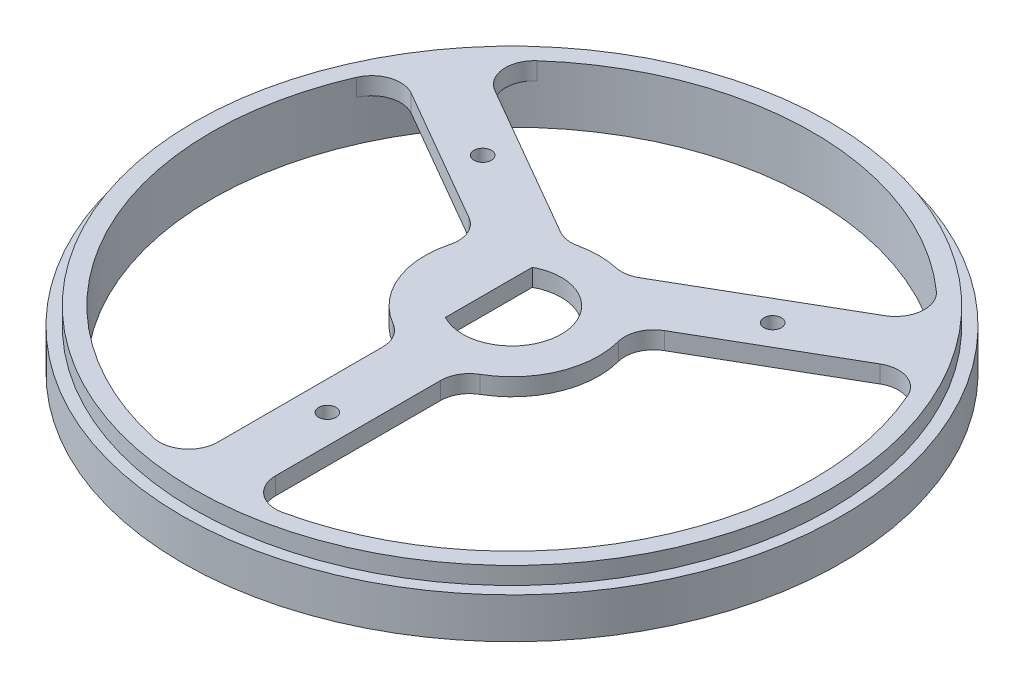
ISO-10303-21;
HEADER;
FILE_DESCRIPTION(('STEP AP214'),'2;1');
FILE_NAME('part.step','',(''),(''),'','','');
FILE_SCHEMA(('AUTOMOTIVE_DESIGN { 1 0 10303 214 1 1 1 1 }'));
ENDSEC;
DATA;
#1=APPLICATION_CONTEXT('core data for automotive mechanical design processes');
#2=APPLICATION_PROTOCOL_DEFINITION('international standard','automotive_design',2000,#1);
#3=PRODUCT_CONTEXT('',#1,'mechanical');
#4=PRODUCT('Part','Part','',(#3));
#5=PRODUCT_RELATED_PRODUCT_CATEGORY('part','',(#4));
#6=PRODUCT_DEFINITION_FORMATION('','',#4);
#7=PRODUCT_DEFINITION_CONTEXT('part definition',#1,'design');
#8=PRODUCT_DEFINITION('design','',#6,#7);
#9=PRODUCT_DEFINITION_SHAPE('','',#8);
#10=(LENGTH_UNIT() NAMED_UNIT(*) SI_UNIT(.MILLI.,.METRE.));
#11=(NAMED_UNIT(*) PLANE_ANGLE_UNIT() SI_UNIT($,.RADIAN.));
#12=(NAMED_UNIT(*) SI_UNIT($,.STERADIAN.) SOLID_ANGLE_UNIT());
#13=UNCERTAINTY_MEASURE_WITH_UNIT(LENGTH_MEASURE(1.E-05),#10,'distance_accuracy_value','');
#14=(GEOMETRIC_REPRESENTATION_CONTEXT(3) GLOBAL_UNCERTAINTY_ASSIGNED_CONTEXT((#13)) GLOBAL_UNIT_ASSIGNED_CONTEXT((#10,
#11,#12)) REPRESENTATION_CONTEXT('',''));
#15=CARTESIAN_POINT('',(0.,0.,0.));
#16=DIRECTION('',(0.,0.,1.));
#17=DIRECTION('',(1.,0.,0.));
#18=AXIS2_PLACEMENT_3D('',#15,#16,#17);
#19=CARTESIAN_POINT('',(0.,7.,0.));
#20=DIRECTION('',(0.,1.,0.));
#21=DIRECTION('',(0.,0.,1.));
#22=AXIS2_PLACEMENT_3D('',#19,#20,#21);
#23=PLANE('',#22);
#24=CARTESIAN_POINT('',(0.,7.,0.));
#25=DIRECTION('',(0.,1.,0.));
#26=DIRECTION('',(0.,0.,1.));
#27=AXIS2_PLACEMENT_3D('',#24,#25,#26);
#28=CIRCLE('',#27,54.85);
#29=CARTESIAN_POINT('',(0.,7.,54.85));
#30=VERTEX_POINT('',#29);
#31=EDGE_CURVE('E343',#30,#30,#28,.T.);
#32=ORIENTED_EDGE('',*,*,#31,.F.);
#33=EDGE_LOOP('',(#32));
#34=FACE_BOUND('',#33,.T.);
#35=CARTESIAN_POINT('',(0.,7.,0.));
#36=DIRECTION('',(0.,1.,0.));
#37=DIRECTION('',(0.,0.,1.));
#38=AXIS2_PLACEMENT_3D('',#35,#36,#37);
#39=CIRCLE('',#38,56.84006118);
#40=CARTESIAN_POINT('',(0.,7.,56.84006118));
#41=VERTEX_POINT('',#40);
#42=EDGE_CURVE('E348',#41,#41,#39,.T.);
#43=ORIENTED_EDGE('',*,*,#42,.T.);
#44=EDGE_LOOP('',(#43));
#45=FACE_BOUND('',#44,.T.);
#46=ADVANCED_FACE('F45',(#34,#45),#23,.T.);
#47=CARTESIAN_POINT('',(0.,0.,0.));
#48=DIRECTION('',(0.,1.,0.));
#49=DIRECTION('',(0.,0.,1.));
#50=AXIS2_PLACEMENT_3D('',#47,#48,#49);
#51=PLANE('',#50);
#52=CARTESIAN_POINT('',(0.,0.,0.));
#53=DIRECTION('',(0.,1.,0.));
#54=DIRECTION('',(0.,0.,1.));
#55=AXIS2_PLACEMENT_3D('',#52,#53,#54);
#56=CIRCLE('',#55,56.84006118);
#57=CARTESIAN_POINT('',(0.,0.,56.84006118));
#58=VERTEX_POINT('',#57);
#59=EDGE_CURVE('E352',#58,#58,#56,.T.);
#60=ORIENTED_EDGE('',*,*,#59,.F.);
#61=EDGE_LOOP('',(#60));
#62=FACE_BOUND('',#61,.T.);
#63=CARTESIAN_POINT('',(0.,0.,0.));
#64=DIRECTION('',(0.,1.,0.));
#65=DIRECTION('',(0.,0.,1.));
#66=AXIS2_PLACEMENT_3D('',#63,#64,#65);
#67=CIRCLE('',#66,51.85);
#68=CARTESIAN_POINT('',(0.,0.,51.85));
#69=VERTEX_POINT('',#68);
#70=EDGE_CURVE('E342',#69,#69,#67,.T.);
#71=ORIENTED_EDGE('',*,*,#70,.T.);
#72=EDGE_LOOP('',(#71));
#73=FACE_BOUND('',#72,.T.);
#74=ADVANCED_FACE('F560',(#62,#73),#51,.F.);
#75=CARTESIAN_POINT('',(0.,7.,0.));
#76=DIRECTION('',(0.,-1.,0.));
#77=DIRECTION('',(0.,0.,-1.));
#78=AXIS2_PLACEMENT_3D('',#75,#76,#77);
#79=CYLINDRICAL_SURFACE('',#78,56.84006118);
#80=ORIENTED_EDGE('',*,*,#42,.F.);
#81=EDGE_LOOP('',(#80));
#82=FACE_BOUND('',#81,.T.);
#83=ORIENTED_EDGE('',*,*,#59,.T.);
#84=EDGE_LOOP('',(#83));
#85=FACE_BOUND('',#84,.T.);
#86=ADVANCED_FACE('F568',(#82,#85),#79,.T.);
#87=CARTESIAN_POINT('',(0.,7.,0.));
#88=DIRECTION('',(0.,-1.,0.));
#89=DIRECTION('',(0.,0.,-1.));
#90=AXIS2_PLACEMENT_3D('',#87,#88,#89);
#91=CYLINDRICAL_SURFACE('',#90,51.85);
#92=CARTESIAN_POINT('',(0.,7.,0.));
#93=DIRECTION('',(0.,1.,0.));
#94=DIRECTION('',(0.,0.,1.));
#95=AXIS2_PLACEMENT_3D('',#92,#93,#94);
#96=CIRCLE('',#95,51.85);
#97=CARTESIAN_POINT('',(47.5268769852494,7.,-20.7272396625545));
#98=VERTEX_POINT('',#97);
#99=CARTESIAN_POINT('',(34.4600602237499,7.,-38.7417958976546));
#100=VERTEX_POINT('',#99);
#101=EDGE_CURVE('E276',#98,#100,#96,.T.);
#102=ORIENTED_EDGE('',*,*,#101,.T.);
#103=DIRECTION('',(0.,-1.,0.));
#104=VECTOR('',#103,1.);
#105=CARTESIAN_POINT('',(34.4600602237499,7.,-38.7417958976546));
#106=LINE('',#105,#104);
#107=CARTESIAN_POINT('',(34.4600602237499,10.,-38.7417958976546));
#108=VERTEX_POINT('',#107);
#109=EDGE_CURVE('E424',#100,#108,#106,.F.);
#110=ORIENTED_EDGE('',*,*,#109,.T.);
#111=CARTESIAN_POINT('',(0.,10.,0.));
#112=DIRECTION('',(0.,1.,0.));
#113=DIRECTION('',(0.,0.,1.));
#114=AXIS2_PLACEMENT_3D('',#111,#112,#113);
#115=CIRCLE('',#114,51.85);
#116=CARTESIAN_POINT('',(-34.4600602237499,10.,-38.7417958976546));
#117=VERTEX_POINT('',#116);
#118=EDGE_CURVE('E338',#108,#117,#115,.T.);
#119=ORIENTED_EDGE('',*,*,#118,.T.);
#120=DIRECTION('',(0.,-1.,0.));
#121=VECTOR('',#120,1.);
#122=CARTESIAN_POINT('',(-34.4600602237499,7.,-38.7417958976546));
#123=LINE('',#122,#121);
#124=CARTESIAN_POINT('',(-34.4600602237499,7.,-38.7417958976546));
#125=VERTEX_POINT('',#124);
#126=EDGE_CURVE('E420',#117,#125,#123,.T.);
#127=ORIENTED_EDGE('',*,*,#126,.T.);
#128=CARTESIAN_POINT('',(0.,7.,0.));
#129=DIRECTION('',(0.,1.,0.));
#130=DIRECTION('',(0.,0.,1.));
#131=AXIS2_PLACEMENT_3D('',#128,#129,#130);
#132=CIRCLE('',#131,51.85);
#133=CARTESIAN_POINT('',(-47.5268769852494,7.,-20.7272396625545));
#134=VERTEX_POINT('',#133);
#135=EDGE_CURVE('E291',#125,#134,#132,.T.);
#136=ORIENTED_EDGE('',*,*,#135,.T.);
#137=DIRECTION('',(0.,-1.,0.));
#138=VECTOR('',#137,1.);
#139=CARTESIAN_POINT('',(-47.5268769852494,7.,-20.7272396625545));
#140=LINE('',#139,#138);
#141=CARTESIAN_POINT('',(-47.5268769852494,10.,-20.7272396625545));
#142=VERTEX_POINT('',#141);
#143=EDGE_CURVE('E416',#134,#142,#140,.F.);
#144=ORIENTED_EDGE('',*,*,#143,.T.);
#145=CARTESIAN_POINT('',(-11.0672358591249,10.,50.6550963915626));
#146=VERTEX_POINT('',#145);
#147=EDGE_CURVE('E298',#142,#146,#115,.T.);
#148=ORIENTED_EDGE('',*,*,#147,.T.);
#149=DIRECTION('',(0.,-1.,0.));
#150=VECTOR('',#149,1.);
#151=CARTESIAN_POINT('',(-11.0672358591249,7.,50.6550963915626));
#152=LINE('',#151,#150);
#153=CARTESIAN_POINT('',(-11.0672358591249,7.,50.6550963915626));
#154=VERTEX_POINT('',#153);
#155=EDGE_CURVE('E412',#146,#154,#152,.T.);
#156=ORIENTED_EDGE('',*,*,#155,.T.);
#157=CARTESIAN_POINT('',(0.,7.,0.));
#158=DIRECTION('',(0.,1.,0.));
#159=DIRECTION('',(0.,0.,1.));
#160=AXIS2_PLACEMENT_3D('',#157,#158,#159);
#161=CIRCLE('',#160,51.85);
#162=CARTESIAN_POINT('',(11.0672358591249,7.,50.6550963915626));
#163=VERTEX_POINT('',#162);
#164=EDGE_CURVE('E261',#154,#163,#161,.T.);
#165=ORIENTED_EDGE('',*,*,#164,.T.);
#166=DIRECTION('',(0.,-1.,0.));
#167=VECTOR('',#166,1.);
#168=CARTESIAN_POINT('',(11.0672358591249,7.,50.6550963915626));
#169=LINE('',#168,#167);
#170=CARTESIAN_POINT('',(11.0672358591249,10.,50.6550963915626));
#171=VERTEX_POINT('',#170);
#172=EDGE_CURVE('E365',#163,#171,#169,.F.);
#173=ORIENTED_EDGE('',*,*,#172,.T.);
#174=CARTESIAN_POINT('',(47.5268769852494,10.,-20.7272396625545));
#175=VERTEX_POINT('',#174);
#176=EDGE_CURVE('E333',#171,#175,#115,.T.);
#177=ORIENTED_EDGE('',*,*,#176,.T.);
#178=DIRECTION('',(0.,-1.,0.));
#179=VECTOR('',#178,1.);
#180=CARTESIAN_POINT('',(47.5268769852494,7.,-20.7272396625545));
#181=LINE('',#180,#179);
#182=EDGE_CURVE('E369',#175,#98,#181,.T.);
#183=ORIENTED_EDGE('',*,*,#182,.T.);
#184=EDGE_LOOP('',(#102,#110,#119,#127,#136,#144,#148,#156,#165,#173,#177,#183));
#185=FACE_BOUND('',#184,.T.);
#186=ORIENTED_EDGE('',*,*,#70,.F.);
#187=EDGE_LOOP('',(#186));
#188=FACE_BOUND('',#187,.T.);
#189=ADVANCED_FACE('F522',(#185,#188),#91,.F.);
#190=CARTESIAN_POINT('',(0.,10.,0.));
#191=DIRECTION('',(0.,1.,0.));
#192=DIRECTION('',(0.,0.,1.));
#193=AXIS2_PLACEMENT_3D('',#190,#191,#192);
#194=PLANE('',#193);
#195=ORIENTED_EDGE('',*,*,#147,.F.);
#196=CARTESIAN_POINT('',(-42.9437644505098,10.,-18.728470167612));
#197=DIRECTION('',(0.,1.,0.));
#198=DIRECTION('',(0.,0.,1.));
#199=AXIS2_PLACEMENT_3D('',#196,#197,#198);
#200=CIRCLE('',#199,5.);
#201=CARTESIAN_POINT('',(-40.4437644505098,10.,-23.0585971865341));
#202=VERTEX_POINT('',#201);
#203=EDGE_CURVE('E494',#142,#202,#200,.F.);
#204=ORIENTED_EDGE('',*,*,#203,.T.);
#205=DIRECTION('',(0.866025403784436,0.,0.500000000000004));
#206=VECTOR('',#205,1.);
#207=CARTESIAN_POINT('',(-13.1148153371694,10.,-7.28022105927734));
#208=LINE('',#207,#206);
#209=CARTESIAN_POINT('',(-16.8387867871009,10.,-9.43025697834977));
#210=VERTEX_POINT('',#209);
#211=EDGE_CURVE('E258',#202,#210,#208,.T.);
#212=ORIENTED_EDGE('',*,*,#211,.T.);
#213=CARTESIAN_POINT('',(-19.3387867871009,10.,-5.10012995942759));
#214=DIRECTION('',(0.,1.,0.));
#215=DIRECTION('',(0.,0.,1.));
#216=AXIS2_PLACEMENT_3D('',#213,#214,#215);
#217=CIRCLE('',#216,5.);
#218=CARTESIAN_POINT('',(-14.5040900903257,10.,-3.82509746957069));
#219=VERTEX_POINT('',#218);
#220=EDGE_CURVE('E501',#210,#219,#217,.F.);
#221=ORIENTED_EDGE('',*,*,#220,.T.);
#222=CARTESIAN_POINT('',(0.,10.,0.));
#223=DIRECTION('',(0.,1.,0.));
#224=DIRECTION('',(0.,0.,1.));
#225=AXIS2_PLACEMENT_3D('',#222,#223,#224);
#226=CIRCLE('',#225,15.);
#227=CARTESIAN_POINT('',(-7.5,10.,12.9903810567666));
#228=VERTEX_POINT('',#227);
#229=EDGE_CURVE('E251',#219,#228,#226,.T.);
#230=ORIENTED_EDGE('',*,*,#229,.T.);
#231=CARTESIAN_POINT('',(-10.,10.,17.3205080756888));
#232=DIRECTION('',(0.,1.,0.));
#233=DIRECTION('',(0.,0.,1.));
#234=AXIS2_PLACEMENT_3D('',#231,#232,#233);
#235=CIRCLE('',#234,5.);
#236=CARTESIAN_POINT('',(-5.,10.,17.3205080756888));
#237=VERTEX_POINT('',#236);
#238=EDGE_CURVE('E507',#228,#237,#235,.F.);
#239=ORIENTED_EDGE('',*,*,#238,.T.);
#240=DIRECTION('',(0.,0.,1.));
#241=VECTOR('',#240,1.);
#242=CARTESIAN_POINT('',(-5.,10.,14.142135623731));
#243=LINE('',#242,#241);
#244=CARTESIAN_POINT('',(-5.,10.,45.7703233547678));
#245=VERTEX_POINT('',#244);
#246=EDGE_CURVE('E302',#237,#245,#243,.T.);
#247=ORIENTED_EDGE('',*,*,#246,.T.);
#248=CARTESIAN_POINT('',(-10.,10.,45.7703233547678));
#249=DIRECTION('',(0.,1.,0.));
#250=DIRECTION('',(0.,0.,1.));
#251=AXIS2_PLACEMENT_3D('',#248,#249,#250);
#252=CIRCLE('',#251,5.);
#253=EDGE_CURVE('E54',#245,#146,#252,.F.);
#254=ORIENTED_EDGE('',*,*,#253,.T.);
#255=EDGE_LOOP('',(#195,#204,#212,#221,#230,#239,#247,#254));
#256=FACE_BOUND('',#255,.T.);
#257=ORIENTED_EDGE('',*,*,#118,.F.);
#258=CARTESIAN_POINT('',(31.1370071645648,10.,-35.0058464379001));
#259=DIRECTION('',(0.,1.,0.));
#260=DIRECTION('',(0.,0.,1.));
#261=AXIS2_PLACEMENT_3D('',#258,#259,#260);
#262=CIRCLE('',#261,5.);
#263=CARTESIAN_POINT('',(33.6370071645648,10.,-30.6757194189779));
#264=VERTEX_POINT('',#263);
#265=EDGE_CURVE('E469',#108,#264,#262,.F.);
#266=ORIENTED_EDGE('',*,*,#265,.T.);
#267=DIRECTION('',(-0.866025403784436,0.,0.500000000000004));
#268=VECTOR('',#267,1.);
#269=CARTESIAN_POINT('',(5.,10.,-14.142135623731));
#270=LINE('',#269,#268);
#271=CARTESIAN_POINT('',(6.82604347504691,10.,-15.1964023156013));
#272=VERTEX_POINT('',#271);
#273=EDGE_CURVE('E318',#264,#272,#270,.T.);
#274=ORIENTED_EDGE('',*,*,#273,.T.);
#275=CARTESIAN_POINT('',(4.32604347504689,10.,-19.5265293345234));
#276=DIRECTION('',(0.,1.,0.));
#277=DIRECTION('',(0.,0.,1.));
#278=AXIS2_PLACEMENT_3D('',#275,#276,#277);
#279=CIRCLE('',#278,5.);
#280=CARTESIAN_POINT('',(3.24453260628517,10.,-14.6448970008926));
#281=VERTEX_POINT('',#280);
#282=EDGE_CURVE('E476',#272,#281,#279,.F.);
#283=ORIENTED_EDGE('',*,*,#282,.T.);
#284=CARTESIAN_POINT('',(0.,10.,0.));
#285=DIRECTION('',(0.,1.,0.));
#286=DIRECTION('',(0.,0.,1.));
#287=AXIS2_PLACEMENT_3D('',#284,#285,#286);
#288=CIRCLE('',#287,15.);
#289=CARTESIAN_POINT('',(-3.24453260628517,10.,-14.6448970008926));
#290=VERTEX_POINT('',#289);
#291=EDGE_CURVE('E322',#281,#290,#288,.T.);
#292=ORIENTED_EDGE('',*,*,#291,.T.);
#293=CARTESIAN_POINT('',(-4.32604347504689,10.,-19.5265293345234));
#294=DIRECTION('',(0.,1.,0.));
#295=DIRECTION('',(0.,0.,1.));
#296=AXIS2_PLACEMENT_3D('',#293,#294,#295);
#297=CIRCLE('',#296,5.);
#298=CARTESIAN_POINT('',(-6.82604347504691,10.,-15.1964023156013));
#299=VERTEX_POINT('',#298);
#300=EDGE_CURVE('E482',#290,#299,#297,.F.);
#301=ORIENTED_EDGE('',*,*,#300,.T.);
#302=DIRECTION('',(-0.866025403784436,0.,-0.500000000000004));
#303=VECTOR('',#302,1.);
#304=CARTESIAN_POINT('',(-5.,10.,-14.142135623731));
#305=LINE('',#304,#303);
#306=CARTESIAN_POINT('',(-33.6370071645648,10.,-30.6757194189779));
#307=VERTEX_POINT('',#306);
#308=EDGE_CURVE('E326',#299,#307,#305,.T.);
#309=ORIENTED_EDGE('',*,*,#308,.T.);
#310=CARTESIAN_POINT('',(-31.1370071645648,10.,-35.0058464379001));
#311=DIRECTION('',(0.,1.,0.));
#312=DIRECTION('',(0.,0.,1.));
#313=AXIS2_PLACEMENT_3D('',#310,#311,#312);
#314=CIRCLE('',#313,5.);
#315=EDGE_CURVE('E488',#307,#117,#314,.F.);
#316=ORIENTED_EDGE('',*,*,#315,.T.);
#317=EDGE_LOOP('',(#257,#266,#274,#283,#292,#301,#309,#316));
#318=FACE_BOUND('',#317,.T.);
#319=CARTESIAN_POINT('',(0.,10.,0.));
#320=DIRECTION('',(0.,1.,0.));
#321=DIRECTION('',(0.,0.,1.));
#322=AXIS2_PLACEMENT_3D('',#319,#320,#321);
#323=CIRCLE('',#322,54.85);
#324=CARTESIAN_POINT('',(0.,10.,54.85));
#325=VERTEX_POINT('',#324);
#326=EDGE_CURVE('E337',#325,#325,#323,.T.);
#327=ORIENTED_EDGE('',*,*,#326,.T.);
#328=EDGE_LOOP('',(#327));
#329=FACE_BOUND('',#328,.T.);
#330=ORIENTED_EDGE('',*,*,#176,.F.);
#331=CARTESIAN_POINT('',(10.,10.,45.7703233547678));
#332=DIRECTION('',(0.,1.,0.));
#333=DIRECTION('',(0.,0.,1.));
#334=AXIS2_PLACEMENT_3D('',#331,#332,#333);
#335=CIRCLE('',#334,5.);
#336=CARTESIAN_POINT('',(5.,10.,45.7703233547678));
#337=VERTEX_POINT('',#336);
#338=EDGE_CURVE('E393',#171,#337,#335,.F.);
#339=ORIENTED_EDGE('',*,*,#338,.T.);
#340=DIRECTION('',(0.,0.,-1.));
#341=VECTOR('',#340,1.);
#342=CARTESIAN_POINT('',(5.,10.,14.142135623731));
#343=LINE('',#342,#341);
#344=CARTESIAN_POINT('',(5.,10.,17.3205080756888));
#345=VERTEX_POINT('',#344);
#346=EDGE_CURVE('E306',#337,#345,#343,.T.);
#347=ORIENTED_EDGE('',*,*,#346,.T.);
#348=CARTESIAN_POINT('',(10.,10.,17.3205080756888));
#349=DIRECTION('',(0.,1.,0.));
#350=DIRECTION('',(0.,0.,1.));
#351=AXIS2_PLACEMENT_3D('',#348,#349,#350);
#352=CIRCLE('',#351,5.);
#353=CARTESIAN_POINT('',(7.5,10.,12.9903810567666));
#354=VERTEX_POINT('',#353);
#355=EDGE_CURVE('E406',#345,#354,#352,.F.);
#356=ORIENTED_EDGE('',*,*,#355,.T.);
#357=CARTESIAN_POINT('',(0.,10.,0.));
#358=DIRECTION('',(0.,1.,0.));
#359=DIRECTION('',(0.,0.,1.));
#360=AXIS2_PLACEMENT_3D('',#357,#358,#359);
#361=CIRCLE('',#360,15.);
#362=CARTESIAN_POINT('',(14.5040900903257,10.,-3.82509746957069));
#363=VERTEX_POINT('',#362);
#364=EDGE_CURVE('E310',#354,#363,#361,.T.);
#365=ORIENTED_EDGE('',*,*,#364,.T.);
#366=CARTESIAN_POINT('',(19.3387867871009,10.,-5.10012995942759));
#367=DIRECTION('',(0.,1.,0.));
#368=DIRECTION('',(0.,0.,1.));
#369=AXIS2_PLACEMENT_3D('',#366,#367,#368);
#370=CIRCLE('',#369,5.);
#371=CARTESIAN_POINT('',(16.8387867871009,10.,-9.43025697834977));
#372=VERTEX_POINT('',#371);
#373=EDGE_CURVE('E400',#363,#372,#370,.F.);
#374=ORIENTED_EDGE('',*,*,#373,.T.);
#375=DIRECTION('',(0.866025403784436,0.,-0.500000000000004));
#376=VECTOR('',#375,1.);
#377=CARTESIAN_POINT('',(13.1148153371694,10.,-7.28022105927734));
#378=LINE('',#377,#376);
#379=CARTESIAN_POINT('',(40.4437644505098,10.,-23.0585971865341));
#380=VERTEX_POINT('',#379);
#381=EDGE_CURVE('E314',#372,#380,#378,.T.);
#382=ORIENTED_EDGE('',*,*,#381,.T.);
#383=CARTESIAN_POINT('',(42.9437644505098,10.,-18.728470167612));
#384=DIRECTION('',(0.,1.,0.));
#385=DIRECTION('',(0.,0.,1.));
#386=AXIS2_PLACEMENT_3D('',#383,#384,#385);
#387=CIRCLE('',#386,5.);
#388=EDGE_CURVE('E387',#380,#175,#387,.F.);
#389=ORIENTED_EDGE('',*,*,#388,.T.);
#390=EDGE_LOOP('',(#330,#339,#347,#356,#365,#374,#382,#389));
#391=FACE_BOUND('',#390,.T.);
#392=CARTESIAN_POINT('',(0.,10.,31.85));
#393=DIRECTION('',(0.,1.,0.));
#394=DIRECTION('',(0.,0.,1.));
#395=AXIS2_PLACEMENT_3D('',#392,#393,#394);
#396=CIRCLE('',#395,1.5);
#397=CARTESIAN_POINT('',(0.,10.,33.35));
#398=VERTEX_POINT('',#397);
#399=EDGE_CURVE('E928',#398,#398,#396,.T.);
#400=ORIENTED_EDGE('',*,*,#399,.F.);
#401=EDGE_LOOP('',(#400));
#402=FACE_BOUND('',#401,.T.);
#403=CARTESIAN_POINT('',(25.0075662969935,10.,-19.9458948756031));
#404=DIRECTION('',(0.,1.,0.));
#405=DIRECTION('',(0.,0.,1.));
#406=AXIS2_PLACEMENT_3D('',#403,#404,#405);
#407=CIRCLE('',#406,1.5);
#408=CARTESIAN_POINT('',(25.0075662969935,10.,-18.4458948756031));
#409=VERTEX_POINT('',#408);
#410=EDGE_CURVE('E922',#409,#409,#407,.T.);
#411=ORIENTED_EDGE('',*,*,#410,.F.);
#412=EDGE_LOOP('',(#411));
#413=FACE_BOUND('',#412,.T.);
#414=CARTESIAN_POINT('',(-25.0075662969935,10.,-19.9458948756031));
#415=DIRECTION('',(0.,1.,0.));
#416=DIRECTION('',(0.,0.,1.));
#417=AXIS2_PLACEMENT_3D('',#414,#415,#416);
#418=CIRCLE('',#417,1.5);
#419=CARTESIAN_POINT('',(-25.0075662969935,10.,-18.4458948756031));
#420=VERTEX_POINT('',#419);
#421=EDGE_CURVE('E244',#420,#420,#418,.T.);
#422=ORIENTED_EDGE('',*,*,#421,.F.);
#423=EDGE_LOOP('',(#422));
#424=FACE_BOUND('',#423,.T.);
#425=DIRECTION('',(0.,0.,1.));
#426=VECTOR('',#425,1.);
#427=CARTESIAN_POINT('',(-4.,10.,0.));
#428=LINE('',#427,#426);
#429=CARTESIAN_POINT('',(-4.,10.,-7.5));
#430=VERTEX_POINT('',#429);
#431=CARTESIAN_POINT('',(-4.,10.,7.5));
#432=VERTEX_POINT('',#431);
#433=EDGE_CURVE('E225',#430,#432,#428,.T.);
#434=ORIENTED_EDGE('',*,*,#433,.F.);
#435=CARTESIAN_POINT('',(0.,10.,0.));
#436=DIRECTION('',(0.,1.,0.));
#437=DIRECTION('',(0.,0.,1.));
#438=AXIS2_PLACEMENT_3D('',#435,#436,#437);
#439=CIRCLE('',#438,8.5);
#440=EDGE_CURVE('E241',#432,#430,#439,.T.);
#441=ORIENTED_EDGE('',*,*,#440,.F.);
#442=EDGE_LOOP('',(#434,#441));
#443=FACE_BOUND('',#442,.T.);
#444=ADVANCED_FACE('F516',(#256,#318,#329,#391,#402,#413,#424,#443),#194,.T.);
#445=CARTESIAN_POINT('',(0.,10.,0.));
#446=DIRECTION('',(0.,-1.,0.));
#447=DIRECTION('',(0.,0.,-1.));
#448=AXIS2_PLACEMENT_3D('',#445,#446,#447);
#449=CYLINDRICAL_SURFACE('',#448,54.85);
#450=ORIENTED_EDGE('',*,*,#326,.F.);
#451=EDGE_LOOP('',(#450));
#452=FACE_BOUND('',#451,.T.);
#453=ORIENTED_EDGE('',*,*,#31,.T.);
#454=EDGE_LOOP('',(#453));
#455=FACE_BOUND('',#454,.T.);
#456=ADVANCED_FACE('F664',(#452,#455),#449,.T.);
#457=CARTESIAN_POINT('',(0.,7.,0.));
#458=DIRECTION('',(0.,1.,0.));
#459=DIRECTION('',(0.,0.,1.));
#460=AXIS2_PLACEMENT_3D('',#457,#458,#459);
#461=CYLINDRICAL_SURFACE('',#460,15.);
#462=ORIENTED_EDGE('',*,*,#229,.F.);
#463=DIRECTION('',(0.,1.,0.));
#464=VECTOR('',#463,1.);
#465=CARTESIAN_POINT('',(-14.5040900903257,7.,-3.82509746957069));
#466=LINE('',#465,#464);
#467=CARTESIAN_POINT('',(-14.5040900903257,7.,-3.82509746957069));
#468=VERTEX_POINT('',#467);
#469=EDGE_CURVE('E460',#219,#468,#466,.F.);
#470=ORIENTED_EDGE('',*,*,#469,.T.);
#471=CARTESIAN_POINT('',(0.,7.,0.));
#472=DIRECTION('',(0.,1.,0.));
#473=DIRECTION('',(0.,0.,1.));
#474=AXIS2_PLACEMENT_3D('',#471,#472,#473);
#475=CIRCLE('',#474,15.);
#476=CARTESIAN_POINT('',(-7.5,7.,12.9903810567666));
#477=VERTEX_POINT('',#476);
#478=EDGE_CURVE('E253',#468,#477,#475,.T.);
#479=ORIENTED_EDGE('',*,*,#478,.T.);
#480=DIRECTION('',(0.,1.,0.));
#481=VECTOR('',#480,1.);
#482=CARTESIAN_POINT('',(-7.5,7.,12.9903810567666));
#483=LINE('',#482,#481);
#484=EDGE_CURVE('E456',#477,#228,#483,.T.);
#485=ORIENTED_EDGE('',*,*,#484,.T.);
#486=EDGE_LOOP('',(#462,#470,#479,#485));
#487=FACE_BOUND('',#486,.T.);
#488=ADVANCED_FACE('F534',(#487),#461,.T.);
#489=CARTESIAN_POINT('',(-13.1148153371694,7.,-7.28022105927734));
#490=DIRECTION('',(-0.500000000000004,0.,0.866025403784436));
#491=DIRECTION('',(0.866025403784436,0.,0.500000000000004));
#492=AXIS2_PLACEMENT_3D('',#489,#490,#491);
#493=PLANE('',#492);
#494=ORIENTED_EDGE('',*,*,#211,.F.);
#495=DIRECTION('',(0.,1.,0.));
#496=VECTOR('',#495,1.);
#497=CARTESIAN_POINT('',(-40.4437644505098,7.,-23.0585971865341));
#498=LINE('',#497,#496);
#499=CARTESIAN_POINT('',(-40.4437644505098,7.,-23.0585971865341));
#500=VERTEX_POINT('',#499);
#501=EDGE_CURVE('E453',#202,#500,#498,.F.);
#502=ORIENTED_EDGE('',*,*,#501,.T.);
#503=DIRECTION('',(0.866025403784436,0.,0.500000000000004));
#504=VECTOR('',#503,1.);
#505=CARTESIAN_POINT('',(-13.1148153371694,7.,-7.28022105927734));
#506=LINE('',#505,#504);
#507=CARTESIAN_POINT('',(-16.8387867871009,7.,-9.43025697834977));
#508=VERTEX_POINT('',#507);
#509=EDGE_CURVE('E294',#500,#508,#506,.T.);
#510=ORIENTED_EDGE('',*,*,#509,.T.);
#511=DIRECTION('',(0.,-1.,0.));
#512=VECTOR('',#511,1.);
#513=CARTESIAN_POINT('',(-16.8387867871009,10.,-9.43025697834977));
#514=LINE('',#513,#512);
#515=EDGE_CURVE('E449',#508,#210,#514,.F.);
#516=ORIENTED_EDGE('',*,*,#515,.T.);
#517=EDGE_LOOP('',(#494,#502,#510,#516));
#518=FACE_BOUND('',#517,.T.);
#519=ADVANCED_FACE('F542',(#518),#493,.T.);
#520=CARTESIAN_POINT('',(-5.,7.,-14.142135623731));
#521=DIRECTION('',(0.500000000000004,0.,-0.866025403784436));
#522=DIRECTION('',(-0.866025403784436,0.,-0.500000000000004));
#523=AXIS2_PLACEMENT_3D('',#520,#521,#522);
#524=PLANE('',#523);
#525=ORIENTED_EDGE('',*,*,#308,.F.);
#526=DIRECTION('',(0.,-1.,0.));
#527=VECTOR('',#526,1.);
#528=CARTESIAN_POINT('',(-6.82604347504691,7.,-15.1964023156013));
#529=LINE('',#528,#527);
#530=CARTESIAN_POINT('',(-6.82604347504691,7.,-15.1964023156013));
#531=VERTEX_POINT('',#530);
#532=EDGE_CURVE('E446',#299,#531,#529,.T.);
#533=ORIENTED_EDGE('',*,*,#532,.T.);
#534=DIRECTION('',(-0.866025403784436,0.,-0.500000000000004));
#535=VECTOR('',#534,1.);
#536=CARTESIAN_POINT('',(-5.,7.,-14.142135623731));
#537=LINE('',#536,#535);
#538=CARTESIAN_POINT('',(-33.6370071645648,7.,-30.6757194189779));
#539=VERTEX_POINT('',#538);
#540=EDGE_CURVE('E287',#531,#539,#537,.T.);
#541=ORIENTED_EDGE('',*,*,#540,.T.);
#542=DIRECTION('',(0.,1.,0.));
#543=VECTOR('',#542,1.);
#544=CARTESIAN_POINT('',(-33.6370071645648,10.,-30.6757194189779));
#545=LINE('',#544,#543);
#546=EDGE_CURVE('E442',#539,#307,#545,.T.);
#547=ORIENTED_EDGE('',*,*,#546,.T.);
#548=EDGE_LOOP('',(#525,#533,#541,#547));
#549=FACE_BOUND('',#548,.T.);
#550=ADVANCED_FACE('F844',(#549),#524,.T.);
#551=CARTESIAN_POINT('',(0.,7.,0.));
#552=DIRECTION('',(0.,1.,0.));
#553=DIRECTION('',(0.,0.,1.));
#554=AXIS2_PLACEMENT_3D('',#551,#552,#553);
#555=CYLINDRICAL_SURFACE('',#554,15.);
#556=ORIENTED_EDGE('',*,*,#291,.F.);
#557=DIRECTION('',(0.,1.,0.));
#558=VECTOR('',#557,1.);
#559=CARTESIAN_POINT('',(3.24453260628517,7.,-14.6448970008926));
#560=LINE('',#559,#558);
#561=CARTESIAN_POINT('',(3.24453260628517,7.,-14.6448970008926));
#562=VERTEX_POINT('',#561);
#563=EDGE_CURVE('E439',#281,#562,#560,.F.);
#564=ORIENTED_EDGE('',*,*,#563,.T.);
#565=CARTESIAN_POINT('',(0.,7.,0.));
#566=DIRECTION('',(0.,1.,0.));
#567=DIRECTION('',(0.,0.,1.));
#568=AXIS2_PLACEMENT_3D('',#565,#566,#567);
#569=CIRCLE('',#568,15.);
#570=CARTESIAN_POINT('',(-3.24453260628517,7.,-14.6448970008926));
#571=VERTEX_POINT('',#570);
#572=EDGE_CURVE('E283',#562,#571,#569,.T.);
#573=ORIENTED_EDGE('',*,*,#572,.T.);
#574=DIRECTION('',(0.,1.,0.));
#575=VECTOR('',#574,1.);
#576=CARTESIAN_POINT('',(-3.24453260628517,7.,-14.6448970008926));
#577=LINE('',#576,#575);
#578=EDGE_CURVE('E435',#571,#290,#577,.T.);
#579=ORIENTED_EDGE('',*,*,#578,.T.);
#580=EDGE_LOOP('',(#556,#564,#573,#579));
#581=FACE_BOUND('',#580,.T.);
#582=ADVANCED_FACE('F615',(#581),#555,.T.);
#583=CARTESIAN_POINT('',(5.,7.,-14.142135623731));
#584=DIRECTION('',(-0.500000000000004,0.,-0.866025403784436));
#585=DIRECTION('',(-0.866025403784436,0.,0.500000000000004));
#586=AXIS2_PLACEMENT_3D('',#583,#584,#585);
#587=PLANE('',#586);
#588=ORIENTED_EDGE('',*,*,#273,.F.);
#589=DIRECTION('',(0.,1.,0.));
#590=VECTOR('',#589,1.);
#591=CARTESIAN_POINT('',(33.6370071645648,7.,-30.6757194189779));
#592=LINE('',#591,#590);
#593=CARTESIAN_POINT('',(33.6370071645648,7.,-30.6757194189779));
#594=VERTEX_POINT('',#593);
#595=EDGE_CURVE('E432',#264,#594,#592,.F.);
#596=ORIENTED_EDGE('',*,*,#595,.T.);
#597=DIRECTION('',(-0.866025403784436,0.,0.500000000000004));
#598=VECTOR('',#597,1.);
#599=CARTESIAN_POINT('',(5.,7.,-14.142135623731));
#600=LINE('',#599,#598);
#601=CARTESIAN_POINT('',(6.82604347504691,7.,-15.1964023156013));
#602=VERTEX_POINT('',#601);
#603=EDGE_CURVE('E279',#594,#602,#600,.T.);
#604=ORIENTED_EDGE('',*,*,#603,.T.);
#605=DIRECTION('',(0.,-1.,0.));
#606=VECTOR('',#605,1.);
#607=CARTESIAN_POINT('',(6.82604347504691,10.,-15.1964023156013));
#608=LINE('',#607,#606);
#609=EDGE_CURVE('E428',#602,#272,#608,.F.);
#610=ORIENTED_EDGE('',*,*,#609,.T.);
#611=EDGE_LOOP('',(#588,#596,#604,#610));
#612=FACE_BOUND('',#611,.T.);
#613=ADVANCED_FACE('F622',(#612),#587,.T.);
#614=CARTESIAN_POINT('',(13.1148153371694,7.,-7.28022105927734));
#615=DIRECTION('',(0.500000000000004,0.,0.866025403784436));
#616=DIRECTION('',(0.866025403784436,0.,-0.500000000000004));
#617=AXIS2_PLACEMENT_3D('',#614,#615,#616);
#618=PLANE('',#617);
#619=DIRECTION('',(0.866025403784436,0.,-0.500000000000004));
#620=VECTOR('',#619,1.);
#621=CARTESIAN_POINT('',(13.1148153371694,7.,-7.28022105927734));
#622=LINE('',#621,#620);
#623=CARTESIAN_POINT('',(16.8387867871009,7.,-9.43025697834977));
#624=VERTEX_POINT('',#623);
#625=CARTESIAN_POINT('',(40.4437644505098,7.,-23.0585971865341));
#626=VERTEX_POINT('',#625);
#627=EDGE_CURVE('E272',#624,#626,#622,.T.);
#628=ORIENTED_EDGE('',*,*,#627,.T.);
#629=DIRECTION('',(0.,1.,0.));
#630=VECTOR('',#629,1.);
#631=CARTESIAN_POINT('',(40.4437644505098,10.,-23.0585971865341));
#632=LINE('',#631,#630);
#633=EDGE_CURVE('E361',#626,#380,#632,.T.);
#634=ORIENTED_EDGE('',*,*,#633,.T.);
#635=ORIENTED_EDGE('',*,*,#381,.F.);
#636=DIRECTION('',(0.,-1.,0.));
#637=VECTOR('',#636,1.);
#638=CARTESIAN_POINT('',(16.8387867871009,7.,-9.43025697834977));
#639=LINE('',#638,#637);
#640=EDGE_CURVE('E347',#372,#624,#639,.T.);
#641=ORIENTED_EDGE('',*,*,#640,.T.);
#642=EDGE_LOOP('',(#628,#634,#635,#641));
#643=FACE_BOUND('',#642,.T.);
#644=ADVANCED_FACE('F632',(#643),#618,.T.);
#645=CARTESIAN_POINT('',(0.,7.,0.));
#646=DIRECTION('',(0.,1.,0.));
#647=DIRECTION('',(0.,0.,1.));
#648=AXIS2_PLACEMENT_3D('',#645,#646,#647);
#649=CYLINDRICAL_SURFACE('',#648,15.);
#650=CARTESIAN_POINT('',(0.,7.,0.));
#651=DIRECTION('',(0.,1.,0.));
#652=DIRECTION('',(0.,0.,1.));
#653=AXIS2_PLACEMENT_3D('',#650,#651,#652);
#654=CIRCLE('',#653,15.);
#655=CARTESIAN_POINT('',(7.5,7.,12.9903810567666));
#656=VERTEX_POINT('',#655);
#657=CARTESIAN_POINT('',(14.5040900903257,7.,-3.82509746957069));
#658=VERTEX_POINT('',#657);
#659=EDGE_CURVE('E268',#656,#658,#654,.T.);
#660=ORIENTED_EDGE('',*,*,#659,.T.);
#661=DIRECTION('',(0.,1.,0.));
#662=VECTOR('',#661,1.);
#663=CARTESIAN_POINT('',(14.5040900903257,7.,-3.82509746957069));
#664=LINE('',#663,#662);
#665=EDGE_CURVE('E383',#658,#363,#664,.T.);
#666=ORIENTED_EDGE('',*,*,#665,.T.);
#667=ORIENTED_EDGE('',*,*,#364,.F.);
#668=DIRECTION('',(0.,1.,0.));
#669=VECTOR('',#668,1.);
#670=CARTESIAN_POINT('',(7.5,7.,12.9903810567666));
#671=LINE('',#670,#669);
#672=EDGE_CURVE('E380',#354,#656,#671,.F.);
#673=ORIENTED_EDGE('',*,*,#672,.T.);
#674=EDGE_LOOP('',(#660,#666,#667,#673));
#675=FACE_BOUND('',#674,.T.);
#676=ADVANCED_FACE('F640',(#675),#649,.T.);
#677=CARTESIAN_POINT('',(5.,7.,14.142135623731));
#678=DIRECTION('',(1.,0.,0.));
#679=DIRECTION('',(0.,0.,-1.));
#680=AXIS2_PLACEMENT_3D('',#677,#678,#679);
#681=PLANE('',#680);
#682=ORIENTED_EDGE('',*,*,#346,.F.);
#683=DIRECTION('',(0.,1.,0.));
#684=VECTOR('',#683,1.);
#685=CARTESIAN_POINT('',(5.,7.,45.7703233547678));
#686=LINE('',#685,#684);
#687=CARTESIAN_POINT('',(5.,7.,45.7703233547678));
#688=VERTEX_POINT('',#687);
#689=EDGE_CURVE('E377',#337,#688,#686,.F.);
#690=ORIENTED_EDGE('',*,*,#689,.T.);
#691=DIRECTION('',(0.,0.,-1.));
#692=VECTOR('',#691,1.);
#693=CARTESIAN_POINT('',(5.,7.,14.142135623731));
#694=LINE('',#693,#692);
#695=CARTESIAN_POINT('',(5.,7.,17.3205080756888));
#696=VERTEX_POINT('',#695);
#697=EDGE_CURVE('E264',#688,#696,#694,.T.);
#698=ORIENTED_EDGE('',*,*,#697,.T.);
#699=DIRECTION('',(0.,-1.,0.));
#700=VECTOR('',#699,1.);
#701=CARTESIAN_POINT('',(5.,10.,17.3205080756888));
#702=LINE('',#701,#700);
#703=EDGE_CURVE('E373',#696,#345,#702,.F.);
#704=ORIENTED_EDGE('',*,*,#703,.T.);
#705=EDGE_LOOP('',(#682,#690,#698,#704));
#706=FACE_BOUND('',#705,.T.);
#707=ADVANCED_FACE('F648',(#706),#681,.T.);
#708=CARTESIAN_POINT('',(-5.,7.,14.142135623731));
#709=DIRECTION('',(-1.,0.,0.));
#710=DIRECTION('',(0.,0.,1.));
#711=AXIS2_PLACEMENT_3D('',#708,#709,#710);
#712=PLANE('',#711);
#713=ORIENTED_EDGE('',*,*,#246,.F.);
#714=DIRECTION('',(0.,-1.,0.));
#715=VECTOR('',#714,1.);
#716=CARTESIAN_POINT('',(-5.,7.,17.3205080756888));
#717=LINE('',#716,#715);
#718=CARTESIAN_POINT('',(-5.,7.,17.3205080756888));
#719=VERTEX_POINT('',#718);
#720=EDGE_CURVE('E66',#237,#719,#717,.T.);
#721=ORIENTED_EDGE('',*,*,#720,.T.);
#722=DIRECTION('',(0.,0.,1.));
#723=VECTOR('',#722,1.);
#724=CARTESIAN_POINT('',(-5.,7.,14.142135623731));
#725=LINE('',#724,#723);
#726=CARTESIAN_POINT('',(-5.,7.,45.7703233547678));
#727=VERTEX_POINT('',#726);
#728=EDGE_CURVE('E257',#719,#727,#725,.T.);
#729=ORIENTED_EDGE('',*,*,#728,.T.);
#730=DIRECTION('',(0.,1.,0.));
#731=VECTOR('',#730,1.);
#732=CARTESIAN_POINT('',(-5.,10.,45.7703233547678));
#733=LINE('',#732,#731);
#734=EDGE_CURVE('E463',#727,#245,#733,.T.);
#735=ORIENTED_EDGE('',*,*,#734,.T.);
#736=EDGE_LOOP('',(#713,#721,#729,#735));
#737=FACE_BOUND('',#736,.T.);
#738=ADVANCED_FACE('F526',(#737),#712,.T.);
#739=CARTESIAN_POINT('',(0.,7.,0.));
#740=DIRECTION('',(0.,1.,0.));
#741=DIRECTION('',(0.,0.,1.));
#742=AXIS2_PLACEMENT_3D('',#739,#740,#741);
#743=PLANE('',#742);
#744=CARTESIAN_POINT('',(0.,7.,31.85));
#745=DIRECTION('',(0.,1.,0.));
#746=DIRECTION('',(0.,0.,1.));
#747=AXIS2_PLACEMENT_3D('',#744,#745,#746);
#748=CIRCLE('',#747,1.5);
#749=CARTESIAN_POINT('',(0.,7.,33.35));
#750=VERTEX_POINT('',#749);
#751=EDGE_CURVE('E911',#750,#750,#748,.T.);
#752=ORIENTED_EDGE('',*,*,#751,.T.);
#753=EDGE_LOOP('',(#752));
#754=FACE_BOUND('',#753,.T.);
#755=CARTESIAN_POINT('',(25.0075662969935,7.,-19.9458948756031));
#756=DIRECTION('',(0.,1.,0.));
#757=DIRECTION('',(0.,0.,1.));
#758=AXIS2_PLACEMENT_3D('',#755,#756,#757);
#759=CIRCLE('',#758,1.5);
#760=CARTESIAN_POINT('',(25.0075662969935,7.,-18.4458948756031));
#761=VERTEX_POINT('',#760);
#762=EDGE_CURVE('E915',#761,#761,#759,.T.);
#763=ORIENTED_EDGE('',*,*,#762,.T.);
#764=EDGE_LOOP('',(#763));
#765=FACE_BOUND('',#764,.T.);
#766=CARTESIAN_POINT('',(-25.0075662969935,7.,-19.9458948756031));
#767=DIRECTION('',(0.,1.,0.));
#768=DIRECTION('',(0.,0.,1.));
#769=AXIS2_PLACEMENT_3D('',#766,#767,#768);
#770=CIRCLE('',#769,1.5);
#771=CARTESIAN_POINT('',(-25.0075662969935,7.,-18.4458948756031));
#772=VERTEX_POINT('',#771);
#773=EDGE_CURVE('E248',#772,#772,#770,.T.);
#774=ORIENTED_EDGE('',*,*,#773,.T.);
#775=EDGE_LOOP('',(#774));
#776=FACE_BOUND('',#775,.T.);
#777=CARTESIAN_POINT('',(0.,7.,0.));
#778=DIRECTION('',(0.,1.,0.));
#779=DIRECTION('',(0.,0.,1.));
#780=AXIS2_PLACEMENT_3D('',#777,#778,#779);
#781=CIRCLE('',#780,8.5);
#782=CARTESIAN_POINT('',(-4.,7.,7.5));
#783=VERTEX_POINT('',#782);
#784=CARTESIAN_POINT('',(-4.,7.,-7.5));
#785=VERTEX_POINT('',#784);
#786=EDGE_CURVE('E231',#783,#785,#781,.T.);
#787=ORIENTED_EDGE('',*,*,#786,.T.);
#788=DIRECTION('',(0.,0.,1.));
#789=VECTOR('',#788,1.);
#790=CARTESIAN_POINT('',(-4.,7.,0.));
#791=LINE('',#790,#789);
#792=EDGE_CURVE('E222',#785,#783,#791,.T.);
#793=ORIENTED_EDGE('',*,*,#792,.T.);
#794=EDGE_LOOP('',(#787,#793));
#795=FACE_BOUND('',#794,.T.);
#796=ORIENTED_EDGE('',*,*,#478,.F.);
#797=CARTESIAN_POINT('',(-19.3387867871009,7.,-5.10012995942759));
#798=DIRECTION('',(0.,1.,0.));
#799=DIRECTION('',(0.,0.,1.));
#800=AXIS2_PLACEMENT_3D('',#797,#798,#799);
#801=CIRCLE('',#800,5.);
#802=EDGE_CURVE('E504',#468,#508,#801,.T.);
#803=ORIENTED_EDGE('',*,*,#802,.T.);
#804=ORIENTED_EDGE('',*,*,#509,.F.);
#805=CARTESIAN_POINT('',(-42.9437644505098,7.,-18.728470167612));
#806=DIRECTION('',(0.,1.,0.));
#807=DIRECTION('',(0.,0.,1.));
#808=AXIS2_PLACEMENT_3D('',#805,#806,#807);
#809=CIRCLE('',#808,5.);
#810=EDGE_CURVE('E497',#500,#134,#809,.T.);
#811=ORIENTED_EDGE('',*,*,#810,.T.);
#812=ORIENTED_EDGE('',*,*,#135,.F.);
#813=CARTESIAN_POINT('',(-31.1370071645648,7.,-35.0058464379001));
#814=DIRECTION('',(0.,1.,0.));
#815=DIRECTION('',(0.,0.,1.));
#816=AXIS2_PLACEMENT_3D('',#813,#814,#815);
#817=CIRCLE('',#816,5.);
#818=EDGE_CURVE('E491',#125,#539,#817,.T.);
#819=ORIENTED_EDGE('',*,*,#818,.T.);
#820=ORIENTED_EDGE('',*,*,#540,.F.);
#821=CARTESIAN_POINT('',(-4.32604347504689,7.,-19.5265293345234));
#822=DIRECTION('',(0.,1.,0.));
#823=DIRECTION('',(0.,0.,1.));
#824=AXIS2_PLACEMENT_3D('',#821,#822,#823);
#825=CIRCLE('',#824,5.);
#826=EDGE_CURVE('E485',#531,#571,#825,.T.);
#827=ORIENTED_EDGE('',*,*,#826,.T.);
#828=ORIENTED_EDGE('',*,*,#572,.F.);
#829=CARTESIAN_POINT('',(4.32604347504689,7.,-19.5265293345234));
#830=DIRECTION('',(0.,1.,0.));
#831=DIRECTION('',(0.,0.,1.));
#832=AXIS2_PLACEMENT_3D('',#829,#830,#831);
#833=CIRCLE('',#832,5.);
#834=EDGE_CURVE('E479',#562,#602,#833,.T.);
#835=ORIENTED_EDGE('',*,*,#834,.T.);
#836=ORIENTED_EDGE('',*,*,#603,.F.);
#837=CARTESIAN_POINT('',(31.1370071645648,7.,-35.0058464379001));
#838=DIRECTION('',(0.,1.,0.));
#839=DIRECTION('',(0.,0.,1.));
#840=AXIS2_PLACEMENT_3D('',#837,#838,#839);
#841=CIRCLE('',#840,5.);
#842=EDGE_CURVE('E472',#594,#100,#841,.T.);
#843=ORIENTED_EDGE('',*,*,#842,.T.);
#844=ORIENTED_EDGE('',*,*,#101,.F.);
#845=CARTESIAN_POINT('',(42.9437644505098,7.,-18.728470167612));
#846=DIRECTION('',(0.,1.,0.));
#847=DIRECTION('',(0.,0.,1.));
#848=AXIS2_PLACEMENT_3D('',#845,#846,#847);
#849=CIRCLE('',#848,5.);
#850=EDGE_CURVE('E390',#98,#626,#849,.T.);
#851=ORIENTED_EDGE('',*,*,#850,.T.);
#852=ORIENTED_EDGE('',*,*,#627,.F.);
#853=CARTESIAN_POINT('',(19.3387867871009,7.,-5.10012995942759));
#854=DIRECTION('',(0.,1.,0.));
#855=DIRECTION('',(0.,0.,1.));
#856=AXIS2_PLACEMENT_3D('',#853,#854,#855);
#857=CIRCLE('',#856,5.);
#858=EDGE_CURVE('E403',#624,#658,#857,.T.);
#859=ORIENTED_EDGE('',*,*,#858,.T.);
#860=ORIENTED_EDGE('',*,*,#659,.F.);
#861=CARTESIAN_POINT('',(10.,7.,17.3205080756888));
#862=DIRECTION('',(0.,1.,0.));
#863=DIRECTION('',(0.,0.,1.));
#864=AXIS2_PLACEMENT_3D('',#861,#862,#863);
#865=CIRCLE('',#864,5.);
#866=EDGE_CURVE('E409',#656,#696,#865,.T.);
#867=ORIENTED_EDGE('',*,*,#866,.T.);
#868=ORIENTED_EDGE('',*,*,#697,.F.);
#869=CARTESIAN_POINT('',(10.,7.,45.7703233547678));
#870=DIRECTION('',(0.,1.,0.));
#871=DIRECTION('',(0.,0.,1.));
#872=AXIS2_PLACEMENT_3D('',#869,#870,#871);
#873=CIRCLE('',#872,5.);
#874=EDGE_CURVE('E396',#688,#163,#873,.T.);
#875=ORIENTED_EDGE('',*,*,#874,.T.);
#876=ORIENTED_EDGE('',*,*,#164,.F.);
#877=CARTESIAN_POINT('',(-10.,7.,45.7703233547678));
#878=DIRECTION('',(0.,1.,0.));
#879=DIRECTION('',(0.,0.,1.));
#880=AXIS2_PLACEMENT_3D('',#877,#878,#879);
#881=CIRCLE('',#880,5.);
#882=EDGE_CURVE('E11',#154,#727,#881,.T.);
#883=ORIENTED_EDGE('',*,*,#882,.T.);
#884=ORIENTED_EDGE('',*,*,#728,.F.);
#885=CARTESIAN_POINT('',(-10.,7.,17.3205080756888));
#886=DIRECTION('',(0.,1.,0.));
#887=DIRECTION('',(0.,0.,1.));
#888=AXIS2_PLACEMENT_3D('',#885,#886,#887);
#889=CIRCLE('',#888,5.);
#890=EDGE_CURVE('E510',#719,#477,#889,.T.);
#891=ORIENTED_EDGE('',*,*,#890,.T.);
#892=EDGE_LOOP('',(#796,#803,#804,#811,#812,#819,#820,#827,#828,#835,#836,#843,#844,#851,#852,
#859,#860,#867,#868,#875,#876,#883,#884,#891));
#893=FACE_BOUND('',#892,.T.);
#894=ADVANCED_FACE('F237',(#754,#765,#776,#795,#893),#743,.F.);
#895=CARTESIAN_POINT('',(-4.,7.,0.));
#896=DIRECTION('',(-1.,0.,0.));
#897=DIRECTION('',(0.,0.,1.));
#898=AXIS2_PLACEMENT_3D('',#895,#896,#897);
#899=PLANE('',#898);
#900=ORIENTED_EDGE('',*,*,#433,.T.);
#901=DIRECTION('',(0.,1.,0.));
#902=VECTOR('',#901,1.);
#903=CARTESIAN_POINT('',(-4.,7.,7.5));
#904=LINE('',#903,#902);
#905=EDGE_CURVE('E218',#783,#432,#904,.T.);
#906=ORIENTED_EDGE('',*,*,#905,.F.);
#907=ORIENTED_EDGE('',*,*,#792,.F.);
#908=DIRECTION('',(0.,1.,0.));
#909=VECTOR('',#908,1.);
#910=CARTESIAN_POINT('',(-4.,7.,-7.5));
#911=LINE('',#910,#909);
#912=EDGE_CURVE('E230',#785,#430,#911,.T.);
#913=ORIENTED_EDGE('',*,*,#912,.T.);
#914=EDGE_LOOP('',(#900,#906,#907,#913));
#915=FACE_BOUND('',#914,.T.);
#916=ADVANCED_FACE('F220',(#915),#899,.F.);
#917=CARTESIAN_POINT('',(0.,7.,0.));
#918=DIRECTION('',(0.,1.,0.));
#919=DIRECTION('',(0.,0.,1.));
#920=AXIS2_PLACEMENT_3D('',#917,#918,#919);
#921=CYLINDRICAL_SURFACE('',#920,8.5);
#922=ORIENTED_EDGE('',*,*,#440,.T.);
#923=ORIENTED_EDGE('',*,*,#912,.F.);
#924=ORIENTED_EDGE('',*,*,#786,.F.);
#925=ORIENTED_EDGE('',*,*,#905,.T.);
#926=EDGE_LOOP('',(#922,#923,#924,#925));
#927=FACE_BOUND('',#926,.T.);
#928=ADVANCED_FACE('F233',(#927),#921,.F.);
#929=CARTESIAN_POINT('',(-25.0075662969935,7.,-19.9458948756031));
#930=DIRECTION('',(0.,1.,0.));
#931=DIRECTION('',(0.,0.,1.));
#932=AXIS2_PLACEMENT_3D('',#929,#930,#931);
#933=CYLINDRICAL_SURFACE('',#932,1.5);
#934=ORIENTED_EDGE('',*,*,#773,.F.);
#935=EDGE_LOOP('',(#934));
#936=FACE_BOUND('',#935,.T.);
#937=ORIENTED_EDGE('',*,*,#421,.T.);
#938=EDGE_LOOP('',(#937));
#939=FACE_BOUND('',#938,.T.);
#940=ADVANCED_FACE('F688',(#936,#939),#933,.F.);
#941=CARTESIAN_POINT('',(25.0075662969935,7.,-19.9458948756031));
#942=DIRECTION('',(0.,1.,0.));
#943=DIRECTION('',(0.,0.,1.));
#944=AXIS2_PLACEMENT_3D('',#941,#942,#943);
#945=CYLINDRICAL_SURFACE('',#944,1.5);
#946=ORIENTED_EDGE('',*,*,#762,.F.);
#947=EDGE_LOOP('',(#946));
#948=FACE_BOUND('',#947,.T.);
#949=ORIENTED_EDGE('',*,*,#410,.T.);
#950=EDGE_LOOP('',(#949));
#951=FACE_BOUND('',#950,.T.);
#952=ADVANCED_FACE('F696',(#948,#951),#945,.F.);
#953=CARTESIAN_POINT('',(0.,7.,31.85));
#954=DIRECTION('',(0.,1.,0.));
#955=DIRECTION('',(0.,0.,1.));
#956=AXIS2_PLACEMENT_3D('',#953,#954,#955);
#957=CYLINDRICAL_SURFACE('',#956,1.5);
#958=ORIENTED_EDGE('',*,*,#751,.F.);
#959=EDGE_LOOP('',(#958));
#960=FACE_BOUND('',#959,.T.);
#961=ORIENTED_EDGE('',*,*,#399,.T.);
#962=EDGE_LOOP('',(#961));
#963=FACE_BOUND('',#962,.T.);
#964=ADVANCED_FACE('F582',(#960,#963),#957,.F.);
#965=CARTESIAN_POINT('',(42.9437644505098,7.,-18.728470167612));
#966=DIRECTION('',(0.,-1.,0.));
#967=DIRECTION('',(0.,0.,-1.));
#968=AXIS2_PLACEMENT_3D('',#965,#966,#967);
#969=CYLINDRICAL_SURFACE('',#968,5.);
#970=ORIENTED_EDGE('',*,*,#850,.F.);
#971=ORIENTED_EDGE('',*,*,#182,.F.);
#972=ORIENTED_EDGE('',*,*,#388,.F.);
#973=ORIENTED_EDGE('',*,*,#633,.F.);
#974=EDGE_LOOP('',(#970,#971,#972,#973));
#975=FACE_BOUND('',#974,.T.);
#976=ADVANCED_FACE('F578',(#975),#969,.F.);
#977=CARTESIAN_POINT('',(10.,7.,45.7703233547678));
#978=DIRECTION('',(0.,-1.,0.));
#979=DIRECTION('',(0.,0.,-1.));
#980=AXIS2_PLACEMENT_3D('',#977,#978,#979);
#981=CYLINDRICAL_SURFACE('',#980,5.);
#982=ORIENTED_EDGE('',*,*,#874,.F.);
#983=ORIENTED_EDGE('',*,*,#689,.F.);
#984=ORIENTED_EDGE('',*,*,#338,.F.);
#985=ORIENTED_EDGE('',*,*,#172,.F.);
#986=EDGE_LOOP('',(#982,#983,#984,#985));
#987=FACE_BOUND('',#986,.T.);
#988=ADVANCED_FACE('F581',(#987),#981,.F.);
#989=CARTESIAN_POINT('',(19.3387867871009,7.,-5.10012995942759));
#990=DIRECTION('',(0.,1.,0.));
#991=DIRECTION('',(0.,0.,1.));
#992=AXIS2_PLACEMENT_3D('',#989,#990,#991);
#993=CYLINDRICAL_SURFACE('',#992,5.);
#994=ORIENTED_EDGE('',*,*,#858,.F.);
#995=ORIENTED_EDGE('',*,*,#640,.F.);
#996=ORIENTED_EDGE('',*,*,#373,.F.);
#997=ORIENTED_EDGE('',*,*,#665,.F.);
#998=EDGE_LOOP('',(#994,#995,#996,#997));
#999=FACE_BOUND('',#998,.T.);
#1000=ADVANCED_FACE('F586',(#999),#993,.F.);
#1001=CARTESIAN_POINT('',(10.,7.,17.3205080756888));
#1002=DIRECTION('',(0.,1.,0.));
#1003=DIRECTION('',(0.,0.,1.));
#1004=AXIS2_PLACEMENT_3D('',#1001,#1002,#1003);
#1005=CYLINDRICAL_SURFACE('',#1004,5.);
#1006=ORIENTED_EDGE('',*,*,#866,.F.);
#1007=ORIENTED_EDGE('',*,*,#672,.F.);
#1008=ORIENTED_EDGE('',*,*,#355,.F.);
#1009=ORIENTED_EDGE('',*,*,#703,.F.);
#1010=EDGE_LOOP('',(#1006,#1007,#1008,#1009));
#1011=FACE_BOUND('',#1010,.T.);
#1012=ADVANCED_FACE('F590',(#1011),#1005,.F.);
#1013=CARTESIAN_POINT('',(31.1370071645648,7.,-35.0058464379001));
#1014=DIRECTION('',(0.,-1.,0.));
#1015=DIRECTION('',(0.,0.,-1.));
#1016=AXIS2_PLACEMENT_3D('',#1013,#1014,#1015);
#1017=CYLINDRICAL_SURFACE('',#1016,5.);
#1018=ORIENTED_EDGE('',*,*,#842,.F.);
#1019=ORIENTED_EDGE('',*,*,#595,.F.);
#1020=ORIENTED_EDGE('',*,*,#265,.F.);
#1021=ORIENTED_EDGE('',*,*,#109,.F.);
#1022=EDGE_LOOP('',(#1018,#1019,#1020,#1021));
#1023=FACE_BOUND('',#1022,.T.);
#1024=ADVANCED_FACE('F594',(#1023),#1017,.F.);
#1025=CARTESIAN_POINT('',(4.32604347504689,7.,-19.5265293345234));
#1026=DIRECTION('',(0.,1.,0.));
#1027=DIRECTION('',(0.,0.,1.));
#1028=AXIS2_PLACEMENT_3D('',#1025,#1026,#1027);
#1029=CYLINDRICAL_SURFACE('',#1028,5.);
#1030=ORIENTED_EDGE('',*,*,#834,.F.);
#1031=ORIENTED_EDGE('',*,*,#563,.F.);
#1032=ORIENTED_EDGE('',*,*,#282,.F.);
#1033=ORIENTED_EDGE('',*,*,#609,.F.);
#1034=EDGE_LOOP('',(#1030,#1031,#1032,#1033));
#1035=FACE_BOUND('',#1034,.T.);
#1036=ADVANCED_FACE('F598',(#1035),#1029,.F.);
#1037=CARTESIAN_POINT('',(-4.32604347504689,7.,-19.5265293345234));
#1038=DIRECTION('',(0.,1.,0.));
#1039=DIRECTION('',(0.,0.,1.));
#1040=AXIS2_PLACEMENT_3D('',#1037,#1038,#1039);
#1041=CYLINDRICAL_SURFACE('',#1040,5.);
#1042=ORIENTED_EDGE('',*,*,#826,.F.);
#1043=ORIENTED_EDGE('',*,*,#532,.F.);
#1044=ORIENTED_EDGE('',*,*,#300,.F.);
#1045=ORIENTED_EDGE('',*,*,#578,.F.);
#1046=EDGE_LOOP('',(#1042,#1043,#1044,#1045));
#1047=FACE_BOUND('',#1046,.T.);
#1048=ADVANCED_FACE('F556',(#1047),#1041,.F.);
#1049=CARTESIAN_POINT('',(-31.1370071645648,7.,-35.0058464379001));
#1050=DIRECTION('',(0.,-1.,0.));
#1051=DIRECTION('',(0.,0.,-1.));
#1052=AXIS2_PLACEMENT_3D('',#1049,#1050,#1051);
#1053=CYLINDRICAL_SURFACE('',#1052,5.);
#1054=ORIENTED_EDGE('',*,*,#818,.F.);
#1055=ORIENTED_EDGE('',*,*,#126,.F.);
#1056=ORIENTED_EDGE('',*,*,#315,.F.);
#1057=ORIENTED_EDGE('',*,*,#546,.F.);
#1058=EDGE_LOOP('',(#1054,#1055,#1056,#1057));
#1059=FACE_BOUND('',#1058,.T.);
#1060=ADVANCED_FACE('F549',(#1059),#1053,.F.);
#1061=CARTESIAN_POINT('',(-42.9437644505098,7.,-18.728470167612));
#1062=DIRECTION('',(0.,-1.,0.));
#1063=DIRECTION('',(0.,0.,-1.));
#1064=AXIS2_PLACEMENT_3D('',#1061,#1062,#1063);
#1065=CYLINDRICAL_SURFACE('',#1064,5.);
#1066=ORIENTED_EDGE('',*,*,#810,.F.);
#1067=ORIENTED_EDGE('',*,*,#501,.F.);
#1068=ORIENTED_EDGE('',*,*,#203,.F.);
#1069=ORIENTED_EDGE('',*,*,#143,.F.);
#1070=EDGE_LOOP('',(#1066,#1067,#1068,#1069));
#1071=FACE_BOUND('',#1070,.T.);
#1072=ADVANCED_FACE('F547',(#1071),#1065,.F.);
#1073=CARTESIAN_POINT('',(-19.3387867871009,7.,-5.10012995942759));
#1074=DIRECTION('',(0.,1.,0.));
#1075=DIRECTION('',(0.,0.,1.));
#1076=AXIS2_PLACEMENT_3D('',#1073,#1074,#1075);
#1077=CYLINDRICAL_SURFACE('',#1076,5.);
#1078=ORIENTED_EDGE('',*,*,#802,.F.);
#1079=ORIENTED_EDGE('',*,*,#469,.F.);
#1080=ORIENTED_EDGE('',*,*,#220,.F.);
#1081=ORIENTED_EDGE('',*,*,#515,.F.);
#1082=EDGE_LOOP('',(#1078,#1079,#1080,#1081));
#1083=FACE_BOUND('',#1082,.T.);
#1084=ADVANCED_FACE('F540',(#1083),#1077,.F.);
#1085=CARTESIAN_POINT('',(-10.,7.,17.3205080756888));
#1086=DIRECTION('',(0.,1.,0.));
#1087=DIRECTION('',(0.,0.,1.));
#1088=AXIS2_PLACEMENT_3D('',#1085,#1086,#1087);
#1089=CYLINDRICAL_SURFACE('',#1088,5.);
#1090=ORIENTED_EDGE('',*,*,#890,.F.);
#1091=ORIENTED_EDGE('',*,*,#720,.F.);
#1092=ORIENTED_EDGE('',*,*,#238,.F.);
#1093=ORIENTED_EDGE('',*,*,#484,.F.);
#1094=EDGE_LOOP('',(#1090,#1091,#1092,#1093));
#1095=FACE_BOUND('',#1094,.T.);
#1096=ADVANCED_FACE('F531',(#1095),#1089,.F.);
#1097=CARTESIAN_POINT('',(-10.,7.,45.7703233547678));
#1098=DIRECTION('',(0.,-1.,0.));
#1099=DIRECTION('',(0.,0.,-1.));
#1100=AXIS2_PLACEMENT_3D('',#1097,#1098,#1099);
#1101=CYLINDRICAL_SURFACE('',#1100,5.);
#1102=ORIENTED_EDGE('',*,*,#882,.F.);
#1103=ORIENTED_EDGE('',*,*,#155,.F.);
#1104=ORIENTED_EDGE('',*,*,#253,.F.);
#1105=ORIENTED_EDGE('',*,*,#734,.F.);
#1106=EDGE_LOOP('',(#1102,#1103,#1104,#1105));
#1107=FACE_BOUND('',#1106,.T.);
#1108=ADVANCED_FACE('F47',(#1107),#1101,.F.);
#1109=CLOSED_SHELL('',(#46,#74,#86,#189,#444,#456,#488,#519,#550,#582,#613,#644,#676,#707,#738,
#894,#916,#928,#940,#952,#964,#976,#988,#1000,#1012,#1024,#1036,#1048,#1060,#1072,#1084,#1096,#1108));
#1110=MANIFOLD_SOLID_BREP('B2',#1109);
#1111=ADVANCED_BREP_SHAPE_REPRESENTATION('',(#18,#1110),#14);
#1112=SHAPE_DEFINITION_REPRESENTATION(#9,#1111);
ENDSEC;
END-ISO-10303-21;
